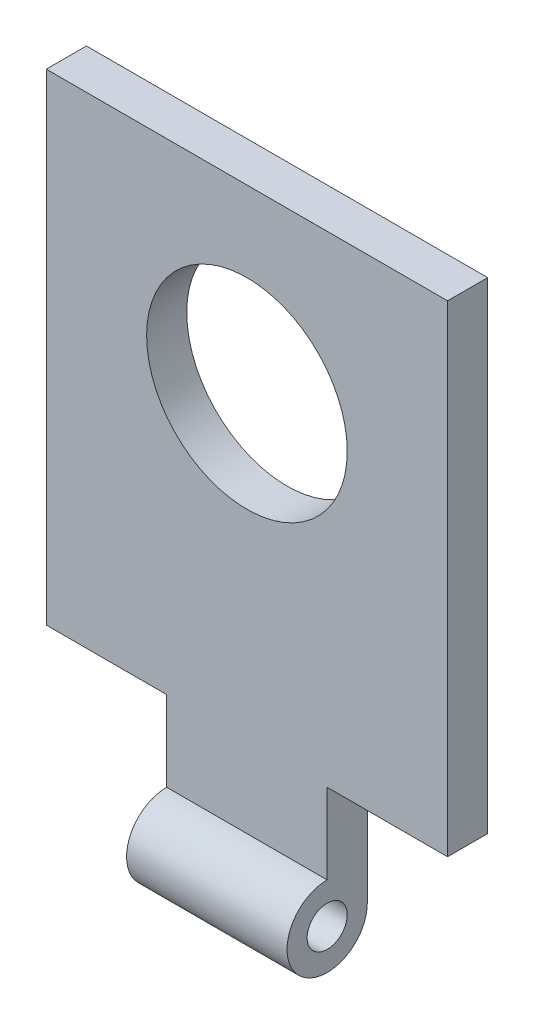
from build123d import *

# Parameters (mm, degrees)
ESQUISSE1_R             = 25
BOSS_EXTRU_1_DEPTH      = 10
ESQUISSE2_R             = 10
BOSS_EXTRU_2_DEPTH      = 40
ESQUISSE3_R             = 5
ENL_V_MAT_EXTRU_1_DEPTH = 167.733320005


with BuildPart() as part:
    # Esquisse1 → Boss.-Extru.1 (new body)
    with BuildSketch(Plane.XY):
        Polygon((30, 0), (70, 0), (70, 30), (100, 30), (100, 150), (0, 150), (0, 30), (30, 30), align=None)
        with Locations((50, 105)):
            Circle(ESQUISSE1_R, mode=Mode.SUBTRACT)
    extrude(amount=BOSS_EXTRU_1_DEPTH)

    # Esquisse2 → Boss.-Extru.2 (add)
    with BuildSketch(Plane.ZY.offset(-30)):
        with Locations((10, 0)):
            Circle(ESQUISSE2_R)
    extrude(amount=-BOSS_EXTRU_2_DEPTH)

    # Esquisse3 → Enl_v. mat.-Extru.1 (cut, through all)
    with BuildSketch(Plane.ZY.offset(-30)):
        with Locations(Location((10, 0, 0), (0, 0, 270))):
            Circle(ESQUISSE3_R)
    extrude(amount=-ENL_V_MAT_EXTRU_1_DEPTH, mode=Mode.SUBTRACT)


solid = part.part
